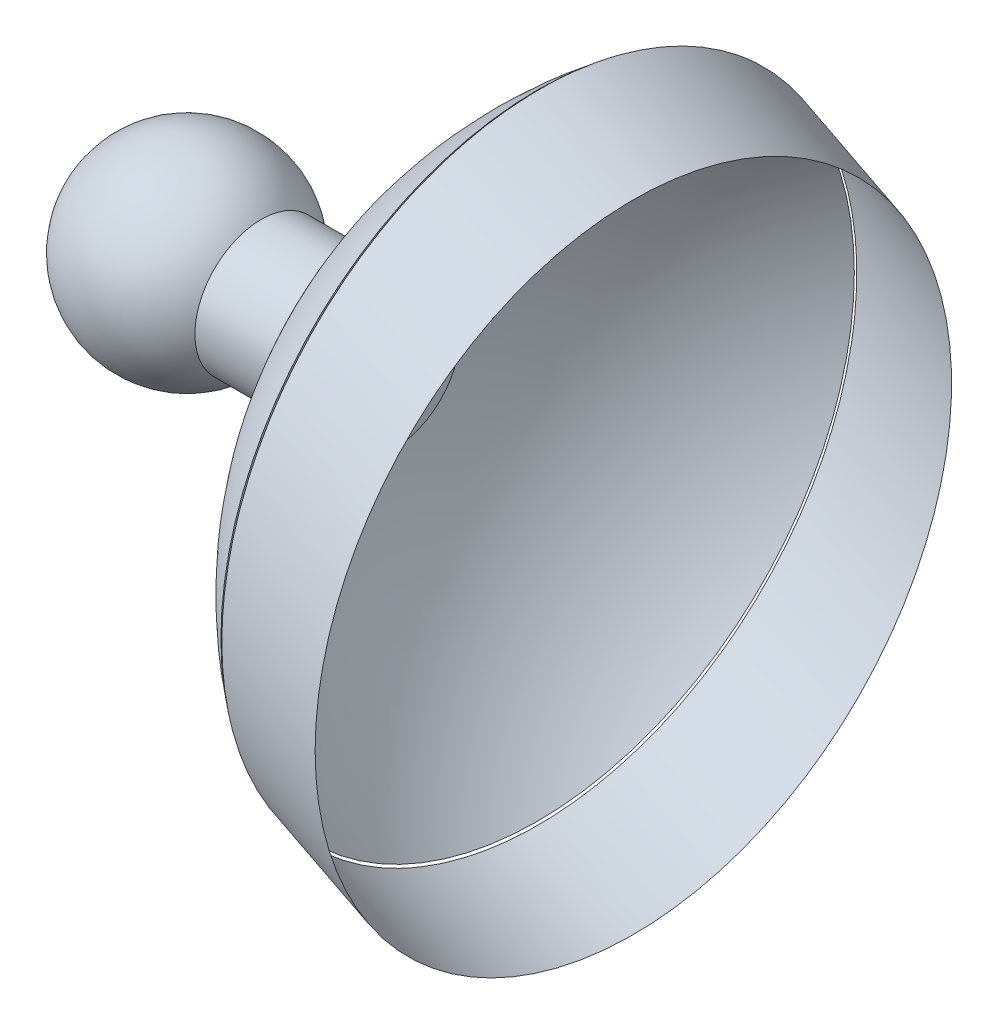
ISO-10303-21;
HEADER;
FILE_DESCRIPTION(('STEP AP214'),'2;1');
FILE_NAME('part.step','',(''),(''),'','','');
FILE_SCHEMA(('AUTOMOTIVE_DESIGN { 1 0 10303 214 1 1 1 1 }'));
ENDSEC;
DATA;
#1=APPLICATION_CONTEXT('core data for automotive mechanical design processes');
#2=APPLICATION_PROTOCOL_DEFINITION('international standard','automotive_design',2000,#1);
#3=PRODUCT_CONTEXT('',#1,'mechanical');
#4=PRODUCT('Part','Part','',(#3));
#5=PRODUCT_RELATED_PRODUCT_CATEGORY('part','',(#4));
#6=PRODUCT_DEFINITION_FORMATION('','',#4);
#7=PRODUCT_DEFINITION_CONTEXT('part definition',#1,'design');
#8=PRODUCT_DEFINITION('design','',#6,#7);
#9=PRODUCT_DEFINITION_SHAPE('','',#8);
#10=(LENGTH_UNIT() NAMED_UNIT(*) SI_UNIT(.MILLI.,.METRE.));
#11=(NAMED_UNIT(*) PLANE_ANGLE_UNIT() SI_UNIT($,.RADIAN.));
#12=(NAMED_UNIT(*) SI_UNIT($,.STERADIAN.) SOLID_ANGLE_UNIT());
#13=UNCERTAINTY_MEASURE_WITH_UNIT(LENGTH_MEASURE(1.E-05),#10,'distance_accuracy_value','');
#14=(GEOMETRIC_REPRESENTATION_CONTEXT(3) GLOBAL_UNCERTAINTY_ASSIGNED_CONTEXT((#13)) GLOBAL_UNIT_ASSIGNED_CONTEXT((#10,
#11,#12)) REPRESENTATION_CONTEXT('',''));
#15=CARTESIAN_POINT('',(0.,0.,0.));
#16=DIRECTION('',(0.,0.,1.));
#17=DIRECTION('',(1.,0.,0.));
#18=AXIS2_PLACEMENT_3D('',#15,#16,#17);
#19=CARTESIAN_POINT('',(3.45944487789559,0.,0.367947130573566));
#20=DIRECTION('',(-1.,0.,0.));
#21=DIRECTION('',(0.,0.,1.));
#22=AXIS2_PLACEMENT_3D('',#19,#20,#21);
#23=CIRCLE('',#22,2.4);
#24=DIRECTION('',(-0.947463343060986,0.,-0.319864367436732));
#25=VECTOR('',#24,1.);
#26=SURFACE_OF_LINEAR_EXTRUSION('',#23,#25);
#27=CARTESIAN_POINT('',(3.45944487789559,0.,2.76794713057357));
#28=VERTEX_POINT('',#27);
#29=EDGE_CURVE('E48',#28,#28,#23,.T.);
#30=ORIENTED_EDGE('',*,*,#29,.T.);
#31=EDGE_LOOP('',(#30));
#32=FACE_BOUND('',#31,.T.);
#33=CARTESIAN_POINT('',(2.39764436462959,0.,2.4094824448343));
#34=CARTESIAN_POINT('',(2.39764445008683,-0.0661324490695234,2.40948566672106));
#35=CARTESIAN_POINT('',(2.39761780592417,-0.132242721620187,2.40674457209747));
#36=CARTESIAN_POINT('',(2.3974585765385,-0.33026310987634,2.39027118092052));
#37=CARTESIAN_POINT('',(2.39724648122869,-0.461592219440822,2.36826647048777));
#38=CARTESIAN_POINT('',(2.39664346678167,-0.718722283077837,2.30284455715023));
#39=CARTESIAN_POINT('',(2.39625254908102,-0.844523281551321,2.25942752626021));
#40=CARTESIAN_POINT('',(2.39534746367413,-1.0872430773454,2.15241070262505));
#41=CARTESIAN_POINT('',(2.39483329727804,-1.20416196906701,2.08881112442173));
#42=CARTESIAN_POINT('',(2.39374100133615,-1.42590189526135,1.94320315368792));
#43=CARTESIAN_POINT('',(2.39316287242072,-1.5307230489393,1.86119494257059));
#44=CARTESIAN_POINT('',(2.39199315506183,-1.72542460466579,1.68103348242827));
#45=CARTESIAN_POINT('',(2.39140156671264,-1.81530511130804,1.58288034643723));
#46=CARTESIAN_POINT('',(2.39024099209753,-1.97768179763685,1.37311833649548));
#47=CARTESIAN_POINT('',(2.3896720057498,-2.05017804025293,1.26150951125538));
#48=CARTESIAN_POINT('',(2.38857855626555,-2.17581393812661,1.02788249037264));
#49=CARTESIAN_POINT('',(2.38805409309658,-2.22895360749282,0.905864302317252));
#50=CARTESIAN_POINT('',(2.38706051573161,-2.31442472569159,0.654744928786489));
#51=CARTESIAN_POINT('',(2.38659140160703,-2.3467561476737,0.525643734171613));
#52=CARTESIAN_POINT('',(2.38571183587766,-2.38972160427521,0.263878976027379));
#53=CARTESIAN_POINT('',(2.38530138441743,-2.40035558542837,0.131215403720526));
#54=CARTESIAN_POINT('',(2.38453796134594,-2.39962623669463,-0.134052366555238));
#55=CARTESIAN_POINT('',(2.38418498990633,-2.38826284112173,-0.266656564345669));
#56=CARTESIAN_POINT('',(2.38353301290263,-2.34383915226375,-0.52818052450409));
#57=CARTESIAN_POINT('',(2.38323400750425,-2.3107787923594,-0.65710027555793));
#58=CARTESIAN_POINT('',(2.38268551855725,-2.2238560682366,-0.907726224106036));
#59=CARTESIAN_POINT('',(2.38243603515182,-2.16999364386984,-1.02943240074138));
#60=CARTESIAN_POINT('',(2.38198205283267,-2.04293338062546,-1.26229549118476));
#61=CARTESIAN_POINT('',(2.3817775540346,-1.96973549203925,-1.37345237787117));
#62=CARTESIAN_POINT('',(2.38140937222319,-1.80600346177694,-1.58216716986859));
#63=CARTESIAN_POINT('',(2.38124568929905,-1.71546928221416,-1.67972504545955));
#64=CARTESIAN_POINT('',(2.38095557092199,-1.51954209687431,-1.85856295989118));
#65=CARTESIAN_POINT('',(2.38082913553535,-1.41414906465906,-1.93984296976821));
#66=CARTESIAN_POINT('',(2.38061064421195,-1.19139197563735,-2.08389181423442));
#67=CARTESIAN_POINT('',(2.38051858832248,-1.07402790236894,-2.14666062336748));
#68=CARTESIAN_POINT('',(2.38036671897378,-0.830547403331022,-2.25196152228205));
#69=CARTESIAN_POINT('',(2.38030690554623,-0.70443096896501,-2.29449359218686));
#70=CARTESIAN_POINT('',(2.38021811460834,-0.446906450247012,-2.35815139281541));
#71=CARTESIAN_POINT('',(2.38018913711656,-0.315498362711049,-2.37927711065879));
#72=CARTESIAN_POINT('',(2.38016133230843,-0.050997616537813,-2.39954113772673));
#73=CARTESIAN_POINT('',(2.38016250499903,0.0820950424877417,-2.39867944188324));
#74=CARTESIAN_POINT('',(2.3801950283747,0.34631124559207,-2.37499233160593));
#75=CARTESIAN_POINT('',(2.38022637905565,0.477434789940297,-2.35216692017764));
#76=CARTESIAN_POINT('',(2.38032000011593,0.734113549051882,-2.28518016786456));
#77=CARTESIAN_POINT('',(2.3803822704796,0.859668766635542,-2.24101883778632));
#78=CARTESIAN_POINT('',(2.38053919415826,1.10176567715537,-2.13257462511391));
#79=CARTESIAN_POINT('',(2.38063384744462,1.21830737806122,-2.0682917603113));
#80=CARTESIAN_POINT('',(2.38085773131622,1.43918129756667,-1.9213715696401));
#81=CARTESIAN_POINT('',(2.38098696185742,1.54351353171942,-1.83873426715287));
#82=CARTESIAN_POINT('',(2.38128292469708,1.73710999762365,-1.65737572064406));
#83=CARTESIAN_POINT('',(2.38144965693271,1.82637425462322,-1.55865450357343));
#84=CARTESIAN_POINT('',(2.38182424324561,1.9873923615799,-1.34783876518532));
#85=CARTESIAN_POINT('',(2.38203209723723,2.05914624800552,-1.23574427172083));
#86=CARTESIAN_POINT('',(2.38249313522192,2.18318422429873,-1.00125720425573));
#87=CARTESIAN_POINT('',(2.38274631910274,2.23546836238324,-0.878864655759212));
#88=CARTESIAN_POINT('',(2.38330256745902,2.31914364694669,-0.627135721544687));
#89=CARTESIAN_POINT('',(2.38360563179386,2.35053485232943,-0.497799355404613));
#90=CARTESIAN_POINT('',(2.38426604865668,2.39157516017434,-0.23572298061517));
#91=CARTESIAN_POINT('',(2.38462340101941,2.40122432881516,-0.102982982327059));
#92=CARTESIAN_POINT('',(2.38539578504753,2.39852703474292,0.162272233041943));
#93=CARTESIAN_POINT('',(2.38581081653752,2.38618063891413,0.294787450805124));
#94=CARTESIAN_POINT('',(2.38669947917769,2.33983876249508,0.555975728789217));
#95=CARTESIAN_POINT('',(2.3871731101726,2.30584333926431,0.684648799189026));
#96=CARTESIAN_POINT('',(2.3881751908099,2.21713783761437,0.934644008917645));
#97=CARTESIAN_POINT('',(2.38870364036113,2.16242779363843,1.05596616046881));
#98=CARTESIAN_POINT('',(2.38980379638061,2.03378673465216,1.28795207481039));
#99=CARTESIAN_POINT('',(2.39037550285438,1.95985571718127,1.39861583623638));
#100=CARTESIAN_POINT('',(2.39153924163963,1.79478531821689,1.60626383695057));
#101=CARTESIAN_POINT('',(2.39213127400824,1.70364588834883,1.70324803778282));
#102=CARTESIAN_POINT('',(2.39329841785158,1.50663066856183,1.88087893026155));
#103=CARTESIAN_POINT('',(2.39387352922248,1.40075478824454,1.96152552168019));
#104=CARTESIAN_POINT('',(2.39495539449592,1.17716047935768,2.10425258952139));
#105=CARTESIAN_POINT('',(2.39546214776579,1.05944194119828,2.16633289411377));
#106=CARTESIAN_POINT('',(2.39634758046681,0.815319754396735,2.27019809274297));
#107=CARTESIAN_POINT('',(2.39672625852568,0.688916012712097,2.31198276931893));
#108=CARTESIAN_POINT('',(2.39721852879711,0.468370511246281,2.36508368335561));
#109=CARTESIAN_POINT('',(2.39737710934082,0.375467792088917,2.38171623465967));
#110=CARTESIAN_POINT('',(2.39758993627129,0.188361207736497,2.40391012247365));
#111=CARTESIAN_POINT('',(2.39764424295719,0.0941581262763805,2.40947785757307));
#112=CARTESIAN_POINT('',(2.39764436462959,0.,2.4094824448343));
#113=B_SPLINE_CURVE_WITH_KNOTS('',3,(#33,#34,#35,#36,#37,#38,#39,#40,#41,#42,#43,#44,#45,#46,
#47,#48,#49,#50,#51,#52,#53,#54,#55,#56,#57,#58,#59,#60,#61,#62,#63,#64,#65,#66,#67,#68,#69,#70,
#71,#72,#73,#74,#75,#76,#77,#78,#79,#80,#81,#82,#83,#84,#85,#86,#87,#88,#89,#90,#91,#92,#93,#94,
#95,#96,#97,#98,#99,#100,#101,#102,#103,#104,#105,#106,#107,#108,#109,#110,#111,#112),
.UNSPECIFIED.,.T.,.F.,(4,2,2,2,2,2,2,2,2,2,2,2,2,2,2,2,2,2,2,2,2,2,2,2,2,2,2,2,2,2,2,2,2,2,2,2,
2,2,2,4),(0.,0.198330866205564,0.595797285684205,0.99326051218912,1.39071951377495,
1.7881745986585,2.1856269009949,2.58307776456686,2.98052833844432,3.377979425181,
3.77543149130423,4.1728847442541,4.57033921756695,4.96779484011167,5.36525148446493,
5.76270899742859,6.16016721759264,6.55762598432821,6.95508514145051,7.35254453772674,
7.75000402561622,8.14746345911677,8.54492269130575,8.9423815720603,9.33983994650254,
9.73729765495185,10.1347545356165,10.532210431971,10.9296652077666,11.3271187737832,
11.7245711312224,12.1220224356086,12.5194730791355,12.9169237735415,13.3143755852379,
13.7118298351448,14.1092877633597,14.5067499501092,14.7892931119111,15.0716728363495),.UNSPECIFIED.);
#114=CARTESIAN_POINT('',(2.39764436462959,0.,2.4094824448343));
#115=VERTEX_POINT('',#114);
#116=EDGE_CURVE('E12',#115,#115,#113,.T.);
#117=ORIENTED_EDGE('',*,*,#116,.T.);
#118=EDGE_LOOP('',(#117));
#119=FACE_BOUND('',#118,.T.);
#120=ADVANCED_FACE('F40',(#32,#119),#26,.T.);
#121=OPEN_SHELL('',(#120));
#122=SHELL_BASED_SURFACE_MODEL('B2',(#121));
#123=CARTESIAN_POINT('',(4.18493123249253,0.,0.));
#124=DIRECTION('',(1.,0.,0.));
#125=DIRECTION('',(0.,1.,0.));
#126=AXIS2_PLACEMENT_3D('',#123,#124,#125);
#127=SPHERICAL_SURFACE('',#126,3.);
#128=CARTESIAN_POINT('',(2.36955661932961,0.,0.));
#129=DIRECTION('',(1.,0.,0.));
#130=DIRECTION('',(0.,0.,-1.));
#131=AXIS2_PLACEMENT_3D('',#128,#129,#130);
#132=CIRCLE('',#131,2.38839172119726);
#133=CARTESIAN_POINT('',(2.36955661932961,0.,-2.38839172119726));
#134=VERTEX_POINT('',#133);
#135=EDGE_CURVE('E39',#134,#134,#132,.T.);
#136=ORIENTED_EDGE('',*,*,#135,.F.);
#137=EDGE_LOOP('',(#136));
#138=FACE_BOUND('',#137,.T.);
#139=ADVANCED_FACE('F77',(#138),#127,.T.);
#140=OPEN_SHELL('',(#139));
#141=SHELL_BASED_SURFACE_MODEL('B7',(#140));
#142=CARTESIAN_POINT('',(-0.274085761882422,0.,0.));
#143=DIRECTION('',(-1.,0.,0.));
#144=DIRECTION('',(0.,1.,0.));
#145=AXIS2_PLACEMENT_3D('',#142,#143,#144);
#146=SPHERICAL_SURFACE('',#145,0.75);
#147=CARTESIAN_POINT('',(0.284931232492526,0.,0.));
#148=DIRECTION('',(-1.,0.,0.));
#149=DIRECTION('',(0.,0.,1.));
#150=AXIS2_PLACEMENT_3D('',#147,#148,#149);
#151=CIRCLE('',#150,0.5);
#152=CARTESIAN_POINT('',(0.284931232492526,0.,0.5));
#153=VERTEX_POINT('',#152);
#154=EDGE_CURVE('E99',#153,#153,#151,.T.);
#155=ORIENTED_EDGE('',*,*,#154,.T.);
#156=EDGE_LOOP('',(#155));
#157=FACE_BOUND('',#156,.T.);
#158=ADVANCED_FACE('F93',(#157),#146,.T.);
#159=CARTESIAN_POINT('',(1.28493123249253,0.5,0.));
#160=DIRECTION('',(-1.,0.,0.));
#161=DIRECTION('',(0.,0.,1.));
#162=AXIS2_PLACEMENT_3D('',#159,#160,#161);
#163=PLANE('',#162);
#164=CARTESIAN_POINT('',(1.28493123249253,0.,0.));
#165=DIRECTION('',(-1.,0.,0.));
#166=DIRECTION('',(0.,0.,1.));
#167=AXIS2_PLACEMENT_3D('',#164,#165,#166);
#168=CIRCLE('',#167,0.5);
#169=CARTESIAN_POINT('',(1.28493123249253,0.,0.5));
#170=VERTEX_POINT('',#169);
#171=EDGE_CURVE('E76',#170,#170,#168,.T.);
#172=ORIENTED_EDGE('',*,*,#171,.F.);
#173=EDGE_LOOP('',(#172));
#174=FACE_BOUND('',#173,.T.);
#175=ADVANCED_FACE('F108',(#174),#163,.F.);
#176=CARTESIAN_POINT('',(-0.581094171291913,0.,0.));
#177=DIRECTION('',(-1.,0.,0.));
#178=DIRECTION('',(0.,0.,1.));
#179=AXIS2_PLACEMENT_3D('',#176,#177,#178);
#180=CYLINDRICAL_SURFACE('',#179,0.5);
#181=ORIENTED_EDGE('',*,*,#154,.F.);
#182=EDGE_LOOP('',(#181));
#183=FACE_BOUND('',#182,.T.);
#184=ORIENTED_EDGE('',*,*,#171,.T.);
#185=EDGE_LOOP('',(#184));
#186=FACE_BOUND('',#185,.T.);
#187=ADVANCED_FACE('F106',(#183,#186),#180,.T.);
#188=CLOSED_SHELL('',(#158,#175,#187));
#189=MANIFOLD_SOLID_BREP('B34',#188);
#190=ADVANCED_BREP_SHAPE_REPRESENTATION('',(#18,#189),#14);
#191=MANIFOLD_SURFACE_SHAPE_REPRESENTATION('',(#18,#122,#141),#14);
#192=SHAPE_REPRESENTATION('',(#18),#14);
#193=SHAPE_DEFINITION_REPRESENTATION(#9,#192);
#194=SHAPE_REPRESENTATION_RELATIONSHIP('','',#192,#190);
#195=SHAPE_REPRESENTATION_RELATIONSHIP('','',#192,#191);
ENDSEC;
END-ISO-10303-21;
